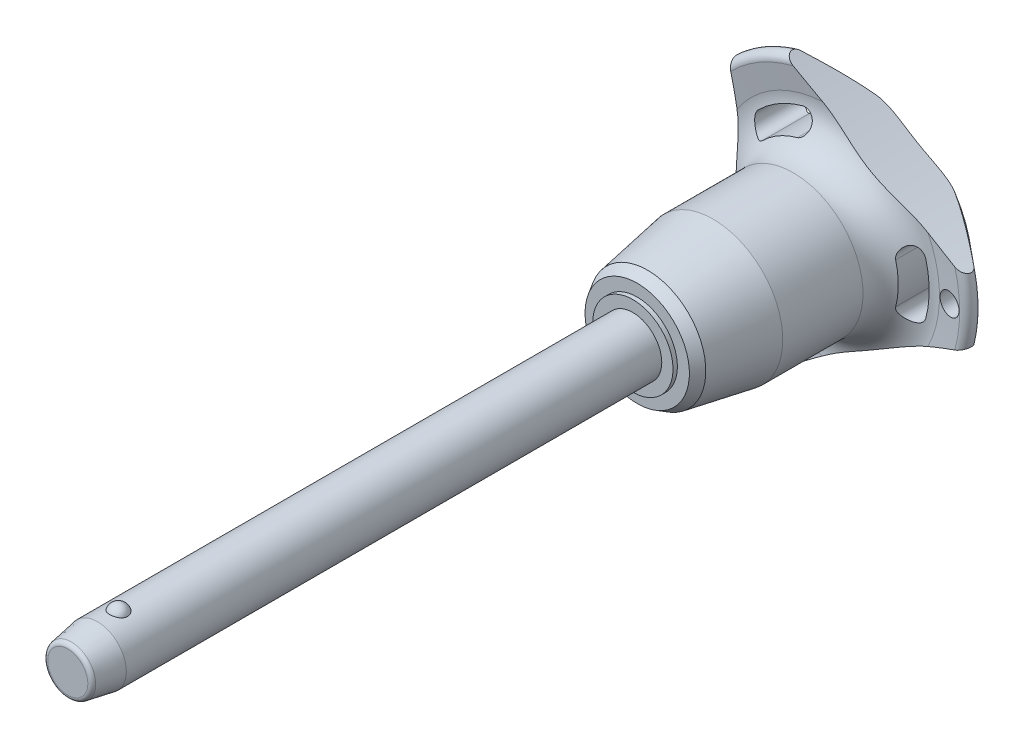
from build123d import *

# Parameters (mm, degrees)
SKETCH1_R           = 4
BOSS_EXTRUDE1_DEPTH = 70
SKETCH2_R           = 3.4
BOSS_EXTRUDE2_DEPTH = 33.3
BOSS_EXTRUDE3_START = 8.2
SKETCH1_2_R         = 4
BOSS_EXTRUDE3_DEPTH = 8.2
CHAMFER1_SIZE       = 4.1
CHAMFER1_SIZE2      = 0.722940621
FILLET1_R           = 0.6
SKETCH6_R           = 102.8
CUT_EXTRUDE1_DEPTH  = 107.957722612
CIRPATTERN1_COUNT   = 3
SKETCH7_R           = 1.5
CUT_EXTRUDE2_DEPTH  = 107.806398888


with BuildPart() as part:
    # Sketch1 → Boss-Extrude1 (new body)
    with BuildSketch(Plane.XY):
        Circle(SKETCH1_R)
    extrude(amount=-BOSS_EXTRUDE1_DEPTH)

    # Sketch2 → Boss-Extrude2 (add)
    with BuildSketch(Plane(origin=(0, 0, -70), x_dir=(-1, 0, 0), z_dir=(0, 0, -1))):
        Circle(SKETCH2_R)
    extrude(amount=BOSS_EXTRUDE2_DEPTH)

    # Sketch3 → Revolve1 (revolve)
    with BuildSketch(Plane(origin=(0, 0, 0), x_dir=(0, 0, -1), z_dir=(1, 0, 0))):
        with BuildLine():
            Line((-1.2, 4.8), (-1.2, 2.2))
            ThreePointArc((-1.2, 2.2), (0.1, 3.5), (-1.2, 4.8))
        make_face()
        with BuildLine():
            Line((-1.2, -2.2), (-1.2, -4.8))
            ThreePointArc((-1.2, -4.8), (0.1, -3.5), (-1.2, -2.2))
        make_face()
    revolve(axis=Axis((0, -2.2, 1.2), (0, 1, 0)))

    # Sketch1_2 → Boss-Extrude3 (add)
    with BuildSketch(Plane.XY.offset(BOSS_EXTRUDE3_START)):
        Circle(SKETCH1_2_R)
    extrude(amount=-BOSS_EXTRUDE3_DEPTH)

    # Chamfer1
    chamfer1_edges = [part.edges().sort_by_distance(p)[0] for p in [
        (-4, 0, 8.2),
    ]]
    chamfer1_side = [part.faces().sort_by_distance(p)[0] for p in [
        (-4, 0, -30.9),
    ]]
    chamfer(chamfer1_edges, length=CHAMFER1_SIZE, length2=CHAMFER1_SIZE2, reference=chamfer1_side[0])

    # Fillet1
    fillet1_edges = [part.edges().sort_by_distance(p)[0] for p in [
        (-3.277059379, 0, 8.2),
        (3.4, 0, -103.3),
    ]]
    fillet(fillet1_edges, radius=FILLET1_R)

    # Sketch4 → Revolve2 (revolve)
    with BuildSketch(Plane(origin=(0, 0, 0), x_dir=(0, 0, -1), z_dir=(1, 0, 0)), mode=Mode.PRIVATE) as revolve2_sk:
        Polygon((70, 0), (70, 5.554101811), (70.6, 5.554101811), (70.6, 7.220004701), (72.042714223, 8.052956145), (81.1, 9.65), (92.2, 9.65), (92.2, 0), align=None)
    revolve(revolve2_sk.sketch.rotate(Axis((0, 0, -92.2), (0, 0, 1)), 90), axis=Axis((0, 0, -92.2), (0, 0, 1)))

    # Sketch5 → Revolve3 (revolve)
    with BuildSketch(Plane(origin=(0, 0, 0), x_dir=(0, 0, -1), z_dir=(1, 0, 0)), mode=Mode.PRIVATE) as revolve3_sk:
        with BuildLine():
            Line((97.16082631, 15.274661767), (96.757834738, 18.475067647))
            ThreePointArc((96.757834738, 18.475067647), (97.349836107, 19.516443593), (98.516044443, 19.24278761))
            Line((98.516044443, 19.24278761), (102.835691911, 14.094832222))
            ThreePointArc((102.835691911, 14.094832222), (103.3, 12.689260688), (102.67067517, 11.349423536))
            ThreePointArc((102.67067517, 11.349423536), (99.033110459, 6.185112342), (97.75, 0))
            Line((97.75, 0), (92.2, 0))
            Line((92.2, 0), (92.2, 9.65))
            ThreePointArc((92.2, 9.65), (95.949887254, 11.342683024), (97.16082631, 15.274661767))
        make_face()
    revolve(revolve3_sk.sketch.rotate(Axis((0, 0, -97.75), (0, 0, 1)), 90), axis=Axis((0, 0, -97.75), (0, 0, 1)))

    # Sketch6 → Cut-Extrude1 (cut, through all)
    with BuildSketch(Plane.XY):
        with Locations((-115.2, 0)):
            Circle(SKETCH6_R)
        with BuildLine():
            ThreePointArc((13.411913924, -3.529271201), (13.868496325, 0), (13.411913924, 3.529271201))
            ThreePointArc((13.411913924, 3.529271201), (11.694200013, 4.531299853), (10.692171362, 2.813585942))
            ThreePointArc((10.692171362, 2.813585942), (11.056165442, 0), (10.692171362, -2.813585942))
            ThreePointArc((10.692171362, -2.813585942), (11.694200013, -4.531299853), (13.411913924, -3.529271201))
        make_face()
    cut_extrude1 = extrude(amount=-CUT_EXTRUDE1_DEPTH, mode=Mode.SUBTRACT)

    # CirPattern1: Cut-Extrude1 ×3 about axis
    cirpattern1_axis = Axis((0, 0, 0), (0, 0, 1))
    for i in range(1, CIRPATTERN1_COUNT):
        add(cut_extrude1.rotate(cirpattern1_axis, i * 360 / CIRPATTERN1_COUNT), mode=Mode.SUBTRACT)

    # Sketch7 → Cut-Extrude2 (cut, through all)
    with BuildSketch(Plane.XY):
        with Locations(Location((16.868496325, 0, 0), (0, 0, 225.467095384))):
            Circle(SKETCH7_R)
    extrude(amount=-CUT_EXTRUDE2_DEPTH, mode=Mode.SUBTRACT)


solid = part.part
